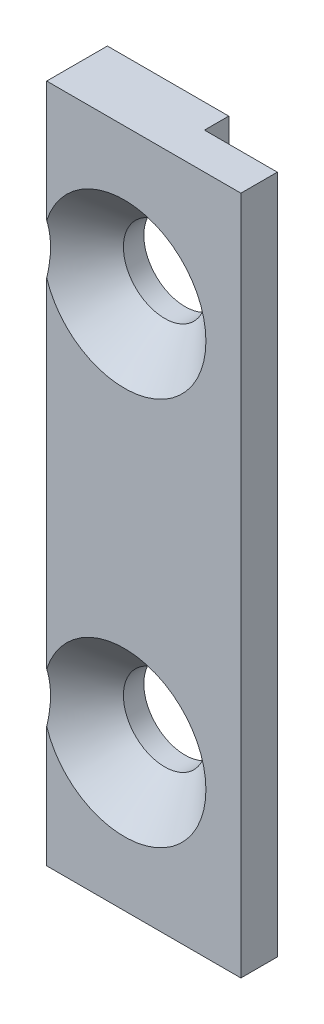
ISO-10303-21;
HEADER;
FILE_DESCRIPTION(('STEP AP214'),'2;1');
FILE_NAME('part.step','',(''),(''),'','','');
FILE_SCHEMA(('AUTOMOTIVE_DESIGN { 1 0 10303 214 1 1 1 1 }'));
ENDSEC;
DATA;
#1=APPLICATION_CONTEXT('core data for automotive mechanical design processes');
#2=APPLICATION_PROTOCOL_DEFINITION('international standard','automotive_design',2000,#1);
#3=PRODUCT_CONTEXT('',#1,'mechanical');
#4=PRODUCT('Part','Part','',(#3));
#5=PRODUCT_RELATED_PRODUCT_CATEGORY('part','',(#4));
#6=PRODUCT_DEFINITION_FORMATION('','',#4);
#7=PRODUCT_DEFINITION_CONTEXT('part definition',#1,'design');
#8=PRODUCT_DEFINITION('design','',#6,#7);
#9=PRODUCT_DEFINITION_SHAPE('','',#8);
#10=(LENGTH_UNIT() NAMED_UNIT(*) SI_UNIT(.MILLI.,.METRE.));
#11=(NAMED_UNIT(*) PLANE_ANGLE_UNIT() SI_UNIT($,.RADIAN.));
#12=(NAMED_UNIT(*) SI_UNIT($,.STERADIAN.) SOLID_ANGLE_UNIT());
#13=UNCERTAINTY_MEASURE_WITH_UNIT(LENGTH_MEASURE(1.E-05),#10,'distance_accuracy_value','');
#14=(GEOMETRIC_REPRESENTATION_CONTEXT(3) GLOBAL_UNCERTAINTY_ASSIGNED_CONTEXT((#13)) GLOBAL_UNIT_ASSIGNED_CONTEXT((#10,
#11,#12)) REPRESENTATION_CONTEXT('',''));
#15=CARTESIAN_POINT('',(0.,0.,0.));
#16=DIRECTION('',(0.,0.,1.));
#17=DIRECTION('',(1.,0.,0.));
#18=AXIS2_PLACEMENT_3D('',#15,#16,#17);
#19=CARTESIAN_POINT('',(0.,0.,2.5));
#20=DIRECTION('',(0.,0.,-1.));
#21=DIRECTION('',(-1.,0.,0.));
#22=AXIS2_PLACEMENT_3D('',#19,#20,#21);
#23=PLANE('',#22);
#24=DIRECTION('',(0.,-1.,0.));
#25=VECTOR('',#24,1.);
#26=CARTESIAN_POINT('',(-446.730887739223,-28.,2.5));
#27=LINE('',#26,#25);
#28=CARTESIAN_POINT('',(-446.730887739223,-7.02449987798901,2.5));
#29=VERTEX_POINT('',#28);
#30=CARTESIAN_POINT('',(-446.730887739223,-20.9755001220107,2.5));
#31=VERTEX_POINT('',#30);
#32=EDGE_CURVE('E235',#29,#31,#27,.T.);
#33=ORIENTED_EDGE('',*,*,#32,.T.);
#34=CARTESIAN_POINT('',(-443.530887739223,-22.,2.5));
#35=DIRECTION('',(0.,0.,1.));
#36=DIRECTION('',(1.,0.,0.));
#37=AXIS2_PLACEMENT_3D('',#34,#35,#36);
#38=CIRCLE('',#37,3.36);
#39=CARTESIAN_POINT('',(-446.730887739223,-23.0244998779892,2.5));
#40=VERTEX_POINT('',#39);
#41=EDGE_CURVE('E169',#40,#31,#38,.T.);
#42=ORIENTED_EDGE('',*,*,#41,.F.);
#43=CARTESIAN_POINT('',(-446.730887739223,-28.,2.5));
#44=VERTEX_POINT('',#43);
#45=EDGE_CURVE('E223',#40,#44,#27,.T.);
#46=ORIENTED_EDGE('',*,*,#45,.T.);
#47=DIRECTION('',(1.,0.,0.));
#48=VECTOR('',#47,1.);
#49=CARTESIAN_POINT('',(-446.730887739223,-28.,2.5));
#50=LINE('',#49,#48);
#51=CARTESIAN_POINT('',(-438.730887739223,-28.,2.5));
#52=VERTEX_POINT('',#51);
#53=EDGE_CURVE('E230',#44,#52,#50,.T.);
#54=ORIENTED_EDGE('',*,*,#53,.T.);
#55=DIRECTION('',(0.,1.,0.));
#56=VECTOR('',#55,1.);
#57=CARTESIAN_POINT('',(-438.730887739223,-28.,2.5));
#58=LINE('',#57,#56);
#59=CARTESIAN_POINT('',(-438.730887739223,2.22044604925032E-13,2.5));
#60=VERTEX_POINT('',#59);
#61=EDGE_CURVE('E228',#52,#60,#58,.T.);
#62=ORIENTED_EDGE('',*,*,#61,.T.);
#63=DIRECTION('',(-1.,0.,0.));
#64=VECTOR('',#63,1.);
#65=CARTESIAN_POINT('',(-446.730887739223,2.21706983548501E-13,2.5));
#66=LINE('',#65,#64);
#67=CARTESIAN_POINT('',(-446.730887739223,2.21706983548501E-13,2.5));
#68=VERTEX_POINT('',#67);
#69=EDGE_CURVE('E125',#60,#68,#66,.T.);
#70=ORIENTED_EDGE('',*,*,#69,.T.);
#71=CARTESIAN_POINT('',(-446.730887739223,-4.97550012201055,2.5));
#72=VERTEX_POINT('',#71);
#73=EDGE_CURVE('E232',#68,#72,#27,.T.);
#74=ORIENTED_EDGE('',*,*,#73,.T.);
#75=CARTESIAN_POINT('',(-443.530887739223,-5.99999999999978,2.5));
#76=DIRECTION('',(0.,0.,1.));
#77=DIRECTION('',(1.,0.,0.));
#78=AXIS2_PLACEMENT_3D('',#75,#76,#77);
#79=CIRCLE('',#78,3.36);
#80=EDGE_CURVE('E241',#29,#72,#79,.T.);
#81=ORIENTED_EDGE('',*,*,#80,.F.);
#82=EDGE_LOOP('',(#33,#42,#46,#54,#62,#70,#74,#81));
#83=FACE_BOUND('',#82,.T.);
#84=ADVANCED_FACE('F16',(#83),#23,.F.);
#85=CARTESIAN_POINT('',(-446.730887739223,-28.,2.5));
#86=DIRECTION('',(1.,0.,0.));
#87=DIRECTION('',(0.,0.,-1.));
#88=AXIS2_PLACEMENT_3D('',#85,#86,#87);
#89=PLANE('',#88);
#90=ORIENTED_EDGE('',*,*,#45,.F.);
#91=CARTESIAN_POINT('',(-446.730887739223,-33.0930996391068,10.6854259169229));
#92=CARTESIAN_POINT('',(-446.730887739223,-32.8166201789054,10.419802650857));
#93=CARTESIAN_POINT('',(-446.730887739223,-32.5397818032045,10.1545510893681));
#94=CARTESIAN_POINT('',(-446.730887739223,-31.9851345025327,9.62503470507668));
#95=CARTESIAN_POINT('',(-446.730887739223,-31.7073255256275,9.3607699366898));
#96=CARTESIAN_POINT('',(-446.730887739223,-31.1497326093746,8.83275917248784));
#97=CARTESIAN_POINT('',(-446.730887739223,-30.869945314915,8.56901671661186));
#98=CARTESIAN_POINT('',(-446.730887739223,-30.3088263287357,8.04320069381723));
#99=CARTESIAN_POINT('',(-446.730887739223,-30.0274946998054,7.78112705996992));
#100=CARTESIAN_POINT('',(-446.730887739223,-29.428949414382,7.2279342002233));
#101=CARTESIAN_POINT('',(-446.730887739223,-29.1114749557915,6.93709679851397));
#102=CARTESIAN_POINT('',(-446.730887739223,-28.4728607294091,6.35936669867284));
#103=CARTESIAN_POINT('',(-446.730887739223,-28.15172047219,6.07247453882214));
#104=CARTESIAN_POINT('',(-446.730887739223,-27.6662505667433,5.64695184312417));
#105=CARTESIAN_POINT('',(-446.730887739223,-27.5039340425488,5.50602605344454));
#106=CARTESIAN_POINT('',(-446.730887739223,-27.1776349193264,5.2261189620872));
#107=CARTESIAN_POINT('',(-446.730887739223,-27.0136523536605,5.08713762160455));
#108=CARTESIAN_POINT('',(-446.730887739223,-26.6836373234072,4.81170169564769));
#109=CARTESIAN_POINT('',(-446.730887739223,-26.5176053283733,4.67524654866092));
#110=CARTESIAN_POINT('',(-446.730887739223,-26.1828995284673,4.40562308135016));
#111=CARTESIAN_POINT('',(-446.730887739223,-26.0142259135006,4.27245452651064));
#112=CARTESIAN_POINT('',(-446.730887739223,-25.7371029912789,4.05948135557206));
#113=CARTESIAN_POINT('',(-446.730887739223,-25.6296934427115,3.9783248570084));
#114=CARTESIAN_POINT('',(-446.730887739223,-25.413276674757,3.81815705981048));
#115=CARTESIAN_POINT('',(-446.730887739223,-25.3042694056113,3.73914582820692));
#116=CARTESIAN_POINT('',(-446.730887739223,-25.0841695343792,3.58364976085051));
#117=CARTESIAN_POINT('',(-446.730887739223,-24.9730735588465,3.50716968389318));
#118=CARTESIAN_POINT('',(-446.730887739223,-24.7486319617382,3.35757923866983));
#119=CARTESIAN_POINT('',(-446.730887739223,-24.6352864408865,3.28446872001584));
#120=CARTESIAN_POINT('',(-446.730887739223,-24.4082150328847,3.14396082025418));
#121=CARTESIAN_POINT('',(-446.730887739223,-24.2945420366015,3.07647845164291));
#122=CARTESIAN_POINT('',(-446.730887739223,-24.0641602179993,2.94679510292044));
#123=CARTESIAN_POINT('',(-446.730887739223,-23.9474506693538,2.88459540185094));
#124=CARTESIAN_POINT('',(-446.730887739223,-23.7109541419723,2.76723786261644));
#125=CARTESIAN_POINT('',(-446.730887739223,-23.5911776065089,2.71205917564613));
#126=CARTESIAN_POINT('',(-446.730887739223,-23.3479608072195,2.6105635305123));
#127=CARTESIAN_POINT('',(-446.730887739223,-23.2245234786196,2.56423968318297));
#128=CARTESIAN_POINT('',(-446.730887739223,-23.0196695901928,2.49768722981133));
#129=CARTESIAN_POINT('',(-446.730887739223,-22.9393423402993,2.47410246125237));
#130=CARTESIAN_POINT('',(-446.730887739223,-22.777318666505,2.43212761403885));
#131=CARTESIAN_POINT('',(-446.730887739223,-22.6956221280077,2.41373797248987));
#132=CARTESIAN_POINT('',(-446.730887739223,-22.5313449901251,2.38281389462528));
#133=CARTESIAN_POINT('',(-446.730887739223,-22.4487673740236,2.37026378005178));
#134=CARTESIAN_POINT('',(-446.730887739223,-22.282901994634,2.35142389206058));
#135=CARTESIAN_POINT('',(-446.730887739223,-22.1996142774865,2.34513371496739));
#136=CARTESIAN_POINT('',(-446.730887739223,-22.0146206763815,2.33842573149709));
#137=CARTESIAN_POINT('',(-446.730887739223,-21.9128529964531,2.33958472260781));
#138=CARTESIAN_POINT('',(-446.730887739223,-21.7098861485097,2.35152483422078));
#139=CARTESIAN_POINT('',(-446.730887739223,-21.6086870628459,2.36230731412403));
#140=CARTESIAN_POINT('',(-446.730887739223,-21.4072554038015,2.39290457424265));
#141=CARTESIAN_POINT('',(-446.730887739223,-21.307028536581,2.41275641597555));
#142=CARTESIAN_POINT('',(-446.730887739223,-21.1085230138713,2.46045804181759));
#143=CARTESIAN_POINT('',(-446.730887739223,-21.0102446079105,2.48830884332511));
#144=CARTESIAN_POINT('',(-446.730887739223,-20.7219771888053,2.58101112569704));
#145=CARTESIAN_POINT('',(-446.730887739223,-20.5351057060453,2.65561596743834));
#146=CARTESIAN_POINT('',(-446.730887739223,-20.2611460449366,2.78101866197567));
#147=CARTESIAN_POINT('',(-446.730887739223,-20.1707982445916,2.82511890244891));
#148=CARTESIAN_POINT('',(-446.730887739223,-19.9920177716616,2.91705108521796));
#149=CARTESIAN_POINT('',(-446.730887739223,-19.9035848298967,2.96488249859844));
#150=CARTESIAN_POINT('',(-446.730887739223,-19.7272121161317,3.06430676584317));
#151=CARTESIAN_POINT('',(-446.730887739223,-19.6392973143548,3.11594349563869));
#152=CARTESIAN_POINT('',(-446.730887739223,-19.4650466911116,3.22181348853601));
#153=CARTESIAN_POINT('',(-446.730887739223,-19.3787109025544,3.27604680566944));
#154=CARTESIAN_POINT('',(-446.730887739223,-19.2075043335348,3.38661777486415));
#155=CARTESIAN_POINT('',(-446.730887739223,-19.1226323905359,3.44295363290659));
#156=CARTESIAN_POINT('',(-446.730887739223,-18.9541159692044,3.55741963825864));
#157=CARTESIAN_POINT('',(-446.730887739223,-18.8704714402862,3.61554971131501));
#158=CARTESIAN_POINT('',(-446.730887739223,-18.5966297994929,3.8095529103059));
#159=CARTESIAN_POINT('',(-446.730887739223,-18.4087019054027,3.94863037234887));
#160=CARTESIAN_POINT('',(-446.730887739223,-18.0370010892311,4.23224854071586));
#161=CARTESIAN_POINT('',(-446.730887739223,-17.8532289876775,4.37679031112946));
#162=CARTESIAN_POINT('',(-446.730887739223,-17.4887486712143,4.66988748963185));
#163=CARTESIAN_POINT('',(-446.730887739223,-17.3080422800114,4.81844515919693));
#164=CARTESIAN_POINT('',(-446.730887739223,-16.9490678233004,5.11847997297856));
#165=CARTESIAN_POINT('',(-446.730887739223,-16.7707998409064,5.26995721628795));
#166=CARTESIAN_POINT('',(-446.730887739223,-16.4157127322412,5.57553164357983));
#167=CARTESIAN_POINT('',(-446.730887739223,-16.238898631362,5.72963465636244));
#168=CARTESIAN_POINT('',(-446.730887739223,-15.8868017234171,6.03958296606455));
#169=CARTESIAN_POINT('',(-446.730887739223,-15.7115189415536,6.19542829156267));
#170=CARTESIAN_POINT('',(-446.730887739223,-15.1876362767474,6.66489985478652));
#171=CARTESIAN_POINT('',(-446.730887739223,-14.8408725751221,6.98057412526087));
#172=CARTESIAN_POINT('',(-446.730887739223,-14.1929517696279,7.57659065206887));
#173=CARTESIAN_POINT('',(-446.730887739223,-13.8914141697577,7.85652112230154));
#174=CARTESIAN_POINT('',(-446.730887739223,-13.2901951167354,8.41843000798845));
#175=CARTESIAN_POINT('',(-446.730887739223,-12.9905138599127,8.70040863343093));
#176=CARTESIAN_POINT('',(-446.730887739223,-12.3940521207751,9.26446839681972));
#177=CARTESIAN_POINT('',(-446.730887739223,-12.0972646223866,9.54654212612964));
#178=CARTESIAN_POINT('',(-446.730887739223,-11.5048361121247,10.1118182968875));
#179=CARTESIAN_POINT('',(-446.730887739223,-11.2091949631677,10.3950205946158));
#180=CARTESIAN_POINT('',(-446.730887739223,-10.9139597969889,10.6786432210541));
#181=B_SPLINE_CURVE_WITH_KNOTS('',3,(#91,#92,#93,#94,#95,#96,#97,#98,#99,#100,#101,#102,#103,
#104,#105,#106,#107,#108,#109,#110,#111,#112,#113,#114,#115,#116,#117,#118,#119,#120,#121,#122,
#123,#124,#125,#126,#127,#128,#129,#130,#131,#132,#133,#134,#135,#136,#137,#138,#139,#140,#141,
#142,#143,#144,#145,#146,#147,#148,#149,#150,#151,#152,#153,#154,#155,#156,#157,#158,#159,#160,
#161,#162,#163,#164,#165,#166,#167,#168,#169,#170,#171,#172,#173,#174,#175,#176,#177,#178,#179,
#180),.UNSPECIFIED.,.F.,.F.,(4,2,2,2,2,2,2,2,2,2,2,2,2,2,2,2,2,2,2,2,2,2,2,2,2,2,2,2,2,2,2,2,2,
2,2,2,2,2,2,2,2,2,2,2,4),(0.,1.15020572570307,2.30047396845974,3.45397189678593,
4.60742326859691,5.89906477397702,7.19088079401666,7.83574206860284,8.48059045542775,
9.12529374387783,9.76995089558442,10.1737973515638,10.5776564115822,10.9822359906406,
11.3867974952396,11.7832722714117,12.1798427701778,12.5752067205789,12.9702618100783,
13.2212701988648,13.4722997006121,13.7226512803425,13.9729867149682,14.2778280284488,
14.5827124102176,14.8888539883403,15.1950345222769,15.7969882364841,16.098559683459,
16.4000884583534,16.7059125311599,17.0117429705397,17.3173181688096,17.622880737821,
18.3240936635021,19.0254438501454,19.7271975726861,20.4289751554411,21.1325930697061,
21.8362225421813,23.2429670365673,24.4772892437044,25.7117398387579,26.9400833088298,
28.1682750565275),.UNSPECIFIED.);
#182=EDGE_CURVE('E144',#40,#31,#181,.T.);
#183=ORIENTED_EDGE('',*,*,#182,.T.);
#184=ORIENTED_EDGE('',*,*,#32,.F.);
#185=CARTESIAN_POINT('',(-446.730887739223,-17.0930996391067,10.6854259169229));
#186=CARTESIAN_POINT('',(-446.730887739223,-16.8166201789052,10.419802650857));
#187=CARTESIAN_POINT('',(-446.730887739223,-16.5397818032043,10.1545510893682));
#188=CARTESIAN_POINT('',(-446.730887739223,-15.9851345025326,9.62503470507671));
#189=CARTESIAN_POINT('',(-446.730887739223,-15.7073255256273,9.36076993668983));
#190=CARTESIAN_POINT('',(-446.730887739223,-15.1497326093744,8.83275917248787));
#191=CARTESIAN_POINT('',(-446.730887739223,-14.8699453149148,8.56901671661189));
#192=CARTESIAN_POINT('',(-446.730887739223,-14.3088263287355,8.04320069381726));
#193=CARTESIAN_POINT('',(-446.730887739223,-14.0274946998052,7.78112705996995));
#194=CARTESIAN_POINT('',(-446.730887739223,-13.4289494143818,7.22793420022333));
#195=CARTESIAN_POINT('',(-446.730887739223,-13.1114749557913,6.93709679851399));
#196=CARTESIAN_POINT('',(-446.730887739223,-12.4728607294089,6.35936669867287));
#197=CARTESIAN_POINT('',(-446.730887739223,-12.1517204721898,6.07247453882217));
#198=CARTESIAN_POINT('',(-446.730887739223,-11.6662505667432,5.64695184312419));
#199=CARTESIAN_POINT('',(-446.730887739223,-11.5039340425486,5.50602605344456));
#200=CARTESIAN_POINT('',(-446.730887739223,-11.1776349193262,5.22611896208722));
#201=CARTESIAN_POINT('',(-446.730887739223,-11.0136523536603,5.08713762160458));
#202=CARTESIAN_POINT('',(-446.730887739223,-10.683637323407,4.81170169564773));
#203=CARTESIAN_POINT('',(-446.730887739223,-10.5176053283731,4.67524654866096));
#204=CARTESIAN_POINT('',(-446.730887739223,-10.1828995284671,4.40562308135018));
#205=CARTESIAN_POINT('',(-446.730887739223,-10.0142259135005,4.27245452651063));
#206=CARTESIAN_POINT('',(-446.730887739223,-9.73710299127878,4.05948135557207));
#207=CARTESIAN_POINT('',(-446.730887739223,-9.6296934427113,3.97832485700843));
#208=CARTESIAN_POINT('',(-446.730887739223,-9.41327667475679,3.81815705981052));
#209=CARTESIAN_POINT('',(-446.730887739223,-9.30426940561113,3.73914582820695));
#210=CARTESIAN_POINT('',(-446.730887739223,-9.08416953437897,3.58364976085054));
#211=CARTESIAN_POINT('',(-446.730887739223,-8.97307355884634,3.5071696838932));
#212=CARTESIAN_POINT('',(-446.730887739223,-8.74863196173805,3.35757923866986));
#213=CARTESIAN_POINT('',(-446.730887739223,-8.63528644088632,3.28446872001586));
#214=CARTESIAN_POINT('',(-446.730887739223,-8.40821503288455,3.14396082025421));
#215=CARTESIAN_POINT('',(-446.730887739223,-8.29454203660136,3.07647845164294));
#216=CARTESIAN_POINT('',(-446.730887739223,-8.06416021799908,2.94679510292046));
#217=CARTESIAN_POINT('',(-446.730887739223,-7.94745066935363,2.88459540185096));
#218=CARTESIAN_POINT('',(-446.730887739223,-7.71095414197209,2.76723786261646));
#219=CARTESIAN_POINT('',(-446.730887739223,-7.59117760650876,2.71205917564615));
#220=CARTESIAN_POINT('',(-446.730887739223,-7.34796080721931,2.61056353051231));
#221=CARTESIAN_POINT('',(-446.730887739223,-7.22452347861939,2.56423968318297));
#222=CARTESIAN_POINT('',(-446.730887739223,-7.01966959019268,2.49768722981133));
#223=CARTESIAN_POINT('',(-446.730887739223,-6.93934234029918,2.47410246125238));
#224=CARTESIAN_POINT('',(-446.730887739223,-6.77731866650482,2.43212761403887));
#225=CARTESIAN_POINT('',(-446.730887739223,-6.69562212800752,2.41373797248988));
#226=CARTESIAN_POINT('',(-446.730887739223,-6.53134499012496,2.38281389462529));
#227=CARTESIAN_POINT('',(-446.730887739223,-6.44876737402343,2.37026378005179));
#228=CARTESIAN_POINT('',(-446.730887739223,-6.2829019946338,2.35142389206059));
#229=CARTESIAN_POINT('',(-446.730887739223,-6.19961427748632,2.34513371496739));
#230=CARTESIAN_POINT('',(-446.730887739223,-6.01462067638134,2.33842573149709));
#231=CARTESIAN_POINT('',(-446.730887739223,-5.91285299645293,2.33958472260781));
#232=CARTESIAN_POINT('',(-446.730887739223,-5.70988614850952,2.35152483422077));
#233=CARTESIAN_POINT('',(-446.730887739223,-5.60868706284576,2.36230731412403));
#234=CARTESIAN_POINT('',(-446.730887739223,-5.40725540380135,2.39290457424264));
#235=CARTESIAN_POINT('',(-446.730887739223,-5.3070285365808,2.41275641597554));
#236=CARTESIAN_POINT('',(-446.730887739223,-5.10852301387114,2.46045804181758));
#237=CARTESIAN_POINT('',(-446.730887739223,-5.01024460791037,2.48830884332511));
#238=CARTESIAN_POINT('',(-446.730887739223,-4.72197718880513,2.58101112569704));
#239=CARTESIAN_POINT('',(-446.730887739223,-4.53510570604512,2.65561596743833));
#240=CARTESIAN_POINT('',(-446.730887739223,-4.26114604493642,2.78101866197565));
#241=CARTESIAN_POINT('',(-446.730887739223,-4.17079824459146,2.82511890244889));
#242=CARTESIAN_POINT('',(-446.730887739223,-3.99201777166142,2.91705108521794));
#243=CARTESIAN_POINT('',(-446.730887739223,-3.90358482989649,2.96488249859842));
#244=CARTESIAN_POINT('',(-446.730887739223,-3.72721211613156,3.06430676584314));
#245=CARTESIAN_POINT('',(-446.730887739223,-3.63929731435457,3.11594349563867));
#246=CARTESIAN_POINT('',(-446.730887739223,-3.46504669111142,3.22181348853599));
#247=CARTESIAN_POINT('',(-446.730887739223,-3.37871090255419,3.27604680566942));
#248=CARTESIAN_POINT('',(-446.730887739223,-3.20750433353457,3.38661777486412));
#249=CARTESIAN_POINT('',(-446.730887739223,-3.12263239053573,3.44295363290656));
#250=CARTESIAN_POINT('',(-446.730887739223,-2.95411596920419,3.55741963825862));
#251=CARTESIAN_POINT('',(-446.730887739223,-2.87047144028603,3.61554971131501));
#252=CARTESIAN_POINT('',(-446.730887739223,-2.5966297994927,3.80955291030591));
#253=CARTESIAN_POINT('',(-446.730887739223,-2.40870190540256,3.94863037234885));
#254=CARTESIAN_POINT('',(-446.730887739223,-2.03700108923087,4.23224854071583));
#255=CARTESIAN_POINT('',(-446.730887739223,-1.85322898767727,4.37679031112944));
#256=CARTESIAN_POINT('',(-446.730887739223,-1.48874867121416,4.66988748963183));
#257=CARTESIAN_POINT('',(-446.730887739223,-1.30804228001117,4.81844515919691));
#258=CARTESIAN_POINT('',(-446.730887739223,-0.949067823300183,5.11847997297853));
#259=CARTESIAN_POINT('',(-446.730887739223,-0.770799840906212,5.26995721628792));
#260=CARTESIAN_POINT('',(-446.730887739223,-0.415712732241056,5.57553164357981));
#261=CARTESIAN_POINT('',(-446.730887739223,-0.238898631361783,5.72963465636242));
#262=CARTESIAN_POINT('',(-446.730887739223,0.113198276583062,6.03958296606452));
#263=CARTESIAN_POINT('',(-446.730887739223,0.288481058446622,6.19542829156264));
#264=CARTESIAN_POINT('',(-446.730887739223,0.812363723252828,6.66489985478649));
#265=CARTESIAN_POINT('',(-446.730887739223,1.15912742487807,6.98057412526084));
#266=CARTESIAN_POINT('',(-446.730887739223,1.80704823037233,7.57659065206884));
#267=CARTESIAN_POINT('',(-446.730887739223,2.10858583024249,7.85652112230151));
#268=CARTESIAN_POINT('',(-446.730887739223,2.70980488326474,8.41843000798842));
#269=CARTESIAN_POINT('',(-446.730887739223,3.00948614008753,8.7004086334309));
#270=CARTESIAN_POINT('',(-446.730887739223,3.60594787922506,9.26446839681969));
#271=CARTESIAN_POINT('',(-446.730887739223,3.9027353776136,9.5465421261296));
#272=CARTESIAN_POINT('',(-446.730887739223,4.4951638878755,10.1118182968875));
#273=CARTESIAN_POINT('',(-446.730887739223,4.79080503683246,10.3950205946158));
#274=CARTESIAN_POINT('',(-446.730887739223,5.08604020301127,10.6786432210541));
#275=B_SPLINE_CURVE_WITH_KNOTS('',3,(#185,#186,#187,#188,#189,#190,#191,#192,#193,#194,#195,
#196,#197,#198,#199,#200,#201,#202,#203,#204,#205,#206,#207,#208,#209,#210,#211,#212,#213,#214,
#215,#216,#217,#218,#219,#220,#221,#222,#223,#224,#225,#226,#227,#228,#229,#230,#231,#232,#233,
#234,#235,#236,#237,#238,#239,#240,#241,#242,#243,#244,#245,#246,#247,#248,#249,#250,#251,#252,
#253,#254,#255,#256,#257,#258,#259,#260,#261,#262,#263,#264,#265,#266,#267,#268,#269,#270,#271,
#272,#273,#274),.UNSPECIFIED.,.F.,.F.,(4,2,2,2,2,2,2,2,2,2,2,2,2,2,2,2,2,2,2,2,2,2,2,2,2,2,2,2,
2,2,2,2,2,2,2,2,2,2,2,2,2,2,2,2,4),(0.,1.15020572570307,2.30047396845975,3.45397189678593,
4.60742326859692,5.89906477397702,7.19088079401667,7.83574206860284,8.48059045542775,
9.12529374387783,9.76995089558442,10.1737973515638,10.5776564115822,10.9822359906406,
11.3867974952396,11.7832722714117,12.1798427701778,12.5752067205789,12.9702618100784,
13.2212701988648,13.4722997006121,13.7226512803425,13.9729867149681,14.2778280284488,
14.5827124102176,14.8888539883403,15.1950345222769,15.7969882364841,16.098559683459,
16.4000884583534,16.7059125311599,17.0117429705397,17.3173181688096,17.622880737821,
18.3240936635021,19.0254438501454,19.7271975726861,20.4289751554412,21.1325930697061,
21.8362225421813,23.2429670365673,24.4772892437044,25.7117398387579,26.9400833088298,
28.1682750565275),.UNSPECIFIED.);
#276=EDGE_CURVE('E136',#29,#72,#275,.T.);
#277=ORIENTED_EDGE('',*,*,#276,.T.);
#278=ORIENTED_EDGE('',*,*,#73,.F.);
#279=DIRECTION('',(0.,0.,-1.));
#280=VECTOR('',#279,1.);
#281=CARTESIAN_POINT('',(-446.730887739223,2.21706983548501E-13,2.5));
#282=LINE('',#281,#280);
#283=CARTESIAN_POINT('',(-446.730887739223,2.21706983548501E-13,0.));
#284=VERTEX_POINT('',#283);
#285=EDGE_CURVE('E126',#68,#284,#282,.T.);
#286=ORIENTED_EDGE('',*,*,#285,.T.);
#287=DIRECTION('',(0.,-1.,0.));
#288=VECTOR('',#287,1.);
#289=CARTESIAN_POINT('',(-446.730887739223,-28.,0.));
#290=LINE('',#289,#288);
#291=CARTESIAN_POINT('',(-446.730887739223,-28.,0.));
#292=VERTEX_POINT('',#291);
#293=EDGE_CURVE('E221',#284,#292,#290,.T.);
#294=ORIENTED_EDGE('',*,*,#293,.T.);
#295=DIRECTION('',(0.,0.,-1.));
#296=VECTOR('',#295,1.);
#297=CARTESIAN_POINT('',(-446.730887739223,-28.,2.5));
#298=LINE('',#297,#296);
#299=EDGE_CURVE('E128',#44,#292,#298,.T.);
#300=ORIENTED_EDGE('',*,*,#299,.F.);
#301=EDGE_LOOP('',(#90,#183,#184,#277,#278,#286,#294,#300));
#302=FACE_BOUND('',#301,.T.);
#303=ADVANCED_FACE('F18',(#302),#89,.F.);
#304=CARTESIAN_POINT('',(-446.730887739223,-28.,2.5));
#305=DIRECTION('',(0.,1.,0.));
#306=DIRECTION('',(0.,0.,1.));
#307=AXIS2_PLACEMENT_3D('',#304,#305,#306);
#308=PLANE('',#307);
#309=DIRECTION('',(1.,0.,0.));
#310=VECTOR('',#309,1.);
#311=CARTESIAN_POINT('',(-446.730887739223,-28.,0.));
#312=LINE('',#311,#310);
#313=CARTESIAN_POINT('',(-441.730887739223,-28.,0.));
#314=VERTEX_POINT('',#313);
#315=EDGE_CURVE('E215',#292,#314,#312,.T.);
#316=ORIENTED_EDGE('',*,*,#315,.T.);
#317=DIRECTION('',(0.,0.,-1.));
#318=VECTOR('',#317,1.);
#319=CARTESIAN_POINT('',(-441.730887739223,-28.,0.));
#320=LINE('',#319,#318);
#321=CARTESIAN_POINT('',(-441.730887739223,-28.,1.));
#322=VERTEX_POINT('',#321);
#323=EDGE_CURVE('E38',#322,#314,#320,.T.);
#324=ORIENTED_EDGE('',*,*,#323,.F.);
#325=DIRECTION('',(-1.,0.,0.));
#326=VECTOR('',#325,1.);
#327=CARTESIAN_POINT('',(-438.730887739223,-28.,1.));
#328=LINE('',#327,#326);
#329=CARTESIAN_POINT('',(-438.730887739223,-28.,1.));
#330=VERTEX_POINT('',#329);
#331=EDGE_CURVE('E261',#330,#322,#328,.T.);
#332=ORIENTED_EDGE('',*,*,#331,.F.);
#333=DIRECTION('',(0.,0.,-1.));
#334=VECTOR('',#333,1.);
#335=CARTESIAN_POINT('',(-438.730887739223,-28.,2.5));
#336=LINE('',#335,#334);
#337=EDGE_CURVE('E120',#52,#330,#336,.T.);
#338=ORIENTED_EDGE('',*,*,#337,.F.);
#339=ORIENTED_EDGE('',*,*,#53,.F.);
#340=ORIENTED_EDGE('',*,*,#299,.T.);
#341=EDGE_LOOP('',(#316,#324,#332,#338,#339,#340));
#342=FACE_BOUND('',#341,.T.);
#343=ADVANCED_FACE('F199',(#342),#308,.F.);
#344=CARTESIAN_POINT('',(-438.730887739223,-28.,2.5));
#345=DIRECTION('',(-1.,0.,0.));
#346=DIRECTION('',(0.,0.,1.));
#347=AXIS2_PLACEMENT_3D('',#344,#345,#346);
#348=PLANE('',#347);
#349=ORIENTED_EDGE('',*,*,#337,.T.);
#350=DIRECTION('',(0.,-1.,0.));
#351=VECTOR('',#350,1.);
#352=CARTESIAN_POINT('',(-438.730887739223,2.22044604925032E-13,1.));
#353=LINE('',#352,#351);
#354=CARTESIAN_POINT('',(-438.730887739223,2.22044604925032E-13,1.));
#355=VERTEX_POINT('',#354);
#356=EDGE_CURVE('E102',#355,#330,#353,.T.);
#357=ORIENTED_EDGE('',*,*,#356,.F.);
#358=DIRECTION('',(0.,0.,-1.));
#359=VECTOR('',#358,1.);
#360=CARTESIAN_POINT('',(-438.730887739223,2.22044604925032E-13,2.5));
#361=LINE('',#360,#359);
#362=EDGE_CURVE('E117',#60,#355,#361,.T.);
#363=ORIENTED_EDGE('',*,*,#362,.F.);
#364=ORIENTED_EDGE('',*,*,#61,.F.);
#365=EDGE_LOOP('',(#349,#357,#363,#364));
#366=FACE_BOUND('',#365,.T.);
#367=ADVANCED_FACE('F115',(#366),#348,.F.);
#368=CARTESIAN_POINT('',(-446.730887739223,2.21706983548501E-13,2.5));
#369=DIRECTION('',(0.,-1.,0.));
#370=DIRECTION('',(1.,0.,0.));
#371=AXIS2_PLACEMENT_3D('',#368,#369,#370);
#372=PLANE('',#371);
#373=DIRECTION('',(-1.,0.,0.));
#374=VECTOR('',#373,1.);
#375=CARTESIAN_POINT('',(-438.730887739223,2.22044604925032E-13,1.));
#376=LINE('',#375,#374);
#377=CARTESIAN_POINT('',(-441.730887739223,2.22044604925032E-13,1.));
#378=VERTEX_POINT('',#377);
#379=EDGE_CURVE('E98',#355,#378,#376,.T.);
#380=ORIENTED_EDGE('',*,*,#379,.T.);
#381=DIRECTION('',(0.,0.,-1.));
#382=VECTOR('',#381,1.);
#383=CARTESIAN_POINT('',(-441.730887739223,2.22044604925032E-13,0.));
#384=LINE('',#383,#382);
#385=CARTESIAN_POINT('',(-441.730887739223,2.22044604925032E-13,0.));
#386=VERTEX_POINT('',#385);
#387=EDGE_CURVE('E110',#378,#386,#384,.T.);
#388=ORIENTED_EDGE('',*,*,#387,.T.);
#389=DIRECTION('',(-1.,0.,0.));
#390=VECTOR('',#389,1.);
#391=CARTESIAN_POINT('',(-446.730887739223,2.21706983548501E-13,0.));
#392=LINE('',#391,#390);
#393=EDGE_CURVE('E220',#386,#284,#392,.T.);
#394=ORIENTED_EDGE('',*,*,#393,.T.);
#395=ORIENTED_EDGE('',*,*,#285,.F.);
#396=ORIENTED_EDGE('',*,*,#69,.F.);
#397=ORIENTED_EDGE('',*,*,#362,.T.);
#398=EDGE_LOOP('',(#380,#388,#394,#395,#396,#397));
#399=FACE_BOUND('',#398,.T.);
#400=ADVANCED_FACE('F123',(#399),#372,.F.);
#401=CARTESIAN_POINT('',(0.,0.,0.));
#402=DIRECTION('',(0.,0.,-1.));
#403=DIRECTION('',(-1.,0.,0.));
#404=AXIS2_PLACEMENT_3D('',#401,#402,#403);
#405=PLANE('',#404);
#406=DIRECTION('',(0.,-1.,0.));
#407=VECTOR('',#406,1.);
#408=CARTESIAN_POINT('',(-441.730887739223,2.22044604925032E-13,0.));
#409=LINE('',#408,#407);
#410=EDGE_CURVE('E258',#386,#314,#409,.T.);
#411=ORIENTED_EDGE('',*,*,#410,.T.);
#412=ORIENTED_EDGE('',*,*,#315,.F.);
#413=ORIENTED_EDGE('',*,*,#293,.F.);
#414=ORIENTED_EDGE('',*,*,#393,.F.);
#415=EDGE_LOOP('',(#411,#412,#413,#414));
#416=FACE_BOUND('',#415,.T.);
#417=CARTESIAN_POINT('',(-443.530887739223,-22.,0.));
#418=DIRECTION('',(0.,0.,1.));
#419=DIRECTION('',(1.,0.,0.));
#420=AXIS2_PLACEMENT_3D('',#417,#418,#419);
#421=CIRCLE('',#420,1.7);
#422=CARTESIAN_POINT('',(-441.830887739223,-22.,0.));
#423=VERTEX_POINT('',#422);
#424=EDGE_CURVE('E243',#423,#423,#421,.T.);
#425=ORIENTED_EDGE('',*,*,#424,.T.);
#426=EDGE_LOOP('',(#425));
#427=FACE_BOUND('',#426,.T.);
#428=CARTESIAN_POINT('',(-443.530887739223,-5.99999999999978,0.));
#429=DIRECTION('',(0.,0.,1.));
#430=DIRECTION('',(1.,0.,0.));
#431=AXIS2_PLACEMENT_3D('',#428,#429,#430);
#432=CIRCLE('',#431,1.7);
#433=CARTESIAN_POINT('',(-441.830887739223,-5.99999999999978,0.));
#434=VERTEX_POINT('',#433);
#435=EDGE_CURVE('E224',#434,#434,#432,.T.);
#436=ORIENTED_EDGE('',*,*,#435,.T.);
#437=EDGE_LOOP('',(#436));
#438=FACE_BOUND('',#437,.T.);
#439=ADVANCED_FACE('F155',(#416,#427,#438),#405,.T.);
#440=CARTESIAN_POINT('',(-443.530887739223,-5.99999999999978,2.5));
#441=DIRECTION('',(0.,0.,1.));
#442=DIRECTION('',(1.,0.,0.));
#443=AXIS2_PLACEMENT_3D('',#440,#441,#442);
#444=CONICAL_SURFACE('',#443,3.36,0.785398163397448);
#445=CARTESIAN_POINT('',(-443.530887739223,-5.99999999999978,1.));
#446=DIRECTION('',(0.,0.,1.));
#447=DIRECTION('',(1.,0.,0.));
#448=AXIS2_PLACEMENT_3D('',#445,#446,#447);
#449=CIRCLE('',#448,1.85999999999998);
#450=CARTESIAN_POINT('',(-441.730887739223,-5.53138501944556,1.));
#451=VERTEX_POINT('',#450);
#452=CARTESIAN_POINT('',(-441.730887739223,-6.468614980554,1.));
#453=VERTEX_POINT('',#452);
#454=EDGE_CURVE('E170',#451,#453,#449,.F.);
#455=ORIENTED_EDGE('',*,*,#454,.T.);
#456=CARTESIAN_POINT('',(-441.730887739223,-7.20930757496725,1.30850750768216));
#457=CARTESIAN_POINT('',(-441.730887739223,-7.14653574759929,1.27354895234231));
#458=CARTESIAN_POINT('',(-441.730887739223,-7.0830174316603,1.23996260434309));
#459=CARTESIAN_POINT('',(-441.730887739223,-6.95392417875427,1.17635588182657));
#460=CARTESIAN_POINT('',(-441.730887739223,-6.88834222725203,1.14634982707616));
#461=CARTESIAN_POINT('',(-441.730887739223,-6.68691813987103,1.06273110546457));
#462=CARTESIAN_POINT('',(-441.730887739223,-6.54777296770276,1.01633543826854));
#463=CARTESIAN_POINT('',(-441.730887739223,-6.31565104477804,0.965389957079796));
#464=CARTESIAN_POINT('',(-441.730887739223,-6.22473742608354,0.951696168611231));
#465=CARTESIAN_POINT('',(-441.730887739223,-6.08797008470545,0.941574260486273));
#466=CARTESIAN_POINT('',(-441.730887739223,-6.04247387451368,0.939924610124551));
#467=CARTESIAN_POINT('',(-441.730887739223,-5.95149085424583,0.940080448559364));
#468=CARTESIAN_POINT('',(-441.730887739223,-5.90600404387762,0.941885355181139));
#469=CARTESIAN_POINT('',(-441.730887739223,-5.80872574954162,0.949393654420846));
#470=CARTESIAN_POINT('',(-441.730887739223,-5.75697484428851,0.955623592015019));
#471=CARTESIAN_POINT('',(-441.730887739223,-5.65415392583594,0.97222088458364));
#472=CARTESIAN_POINT('',(-441.730887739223,-5.60308388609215,0.982588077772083));
#473=CARTESIAN_POINT('',(-441.730887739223,-5.50123268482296,1.00716237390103));
#474=CARTESIAN_POINT('',(-441.730887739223,-5.45046247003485,1.0214143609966));
#475=CARTESIAN_POINT('',(-441.730887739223,-5.34997792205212,1.0531795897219));
#476=CARTESIAN_POINT('',(-441.730887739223,-5.30026335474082,1.07069209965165));
#477=CARTESIAN_POINT('',(-441.730887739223,-5.18266812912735,1.11586387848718));
#478=CARTESIAN_POINT('',(-441.730887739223,-5.11528465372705,1.14481324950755));
#479=CARTESIAN_POINT('',(-441.730887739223,-4.98244671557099,1.20687263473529));
#480=CARTESIAN_POINT('',(-441.730887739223,-4.91699337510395,1.2399850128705));
#481=CARTESIAN_POINT('',(-441.730887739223,-4.78759919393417,1.30954602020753));
#482=CARTESIAN_POINT('',(-441.730887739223,-4.72366452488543,1.34600604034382));
#483=CARTESIAN_POINT('',(-441.730887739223,-4.59729824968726,1.42144763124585));
#484=CARTESIAN_POINT('',(-441.730887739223,-4.53486687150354,1.46042958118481));
#485=CARTESIAN_POINT('',(-441.730887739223,-4.41437178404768,1.53837737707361));
#486=CARTESIAN_POINT('',(-441.730887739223,-4.35624553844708,1.57724705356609));
#487=CARTESIAN_POINT('',(-441.730887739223,-4.24097855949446,1.65642671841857));
#488=CARTESIAN_POINT('',(-441.730887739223,-4.18383790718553,1.69673682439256));
#489=CARTESIAN_POINT('',(-441.730887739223,-4.07090630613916,1.77815882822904));
#490=CARTESIAN_POINT('',(-441.730887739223,-4.01510786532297,1.81926037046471));
#491=CARTESIAN_POINT('',(-441.730887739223,-3.90423956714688,1.90240530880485));
#492=CARTESIAN_POINT('',(-441.730887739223,-3.84916951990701,1.94444845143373));
#493=CARTESIAN_POINT('',(-441.730887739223,-3.79439869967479,1.98687145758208));
#494=B_SPLINE_CURVE_WITH_KNOTS('',3,(#456,#457,#458,#459,#460,#461,#462,#463,#464,#465,#466,
#467,#468,#469,#470,#471,#472,#473,#474,#475,#476,#477,#478,#479,#480,#481,#482,#483,#484,#485,
#486,#487,#488,#489,#490,#491,#492,#493),.UNSPECIFIED.,.F.,.F.,(4,2,2,2,2,2,2,2,2,2,2,2,2,2,2,2,
2,2,4),(0.,0.215472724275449,0.431780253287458,0.86916619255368,1.1439794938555,
1.28043934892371,1.41687620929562,1.57306459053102,1.72924686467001,1.8873162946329,
2.0453502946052,2.26517338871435,2.48512187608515,2.70584866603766,2.92660871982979,
3.1363581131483,3.34612467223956,3.55402062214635,3.76186126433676),.UNSPECIFIED.);
#495=EDGE_CURVE('E161',#453,#451,#494,.T.);
#496=ORIENTED_EDGE('',*,*,#495,.T.);
#497=EDGE_LOOP('',(#455,#496));
#498=FACE_BOUND('',#497,.T.);
#499=CARTESIAN_POINT('',(-443.530887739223,-5.99999999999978,0.84));
#500=DIRECTION('',(0.,0.,1.));
#501=DIRECTION('',(1.,0.,0.));
#502=AXIS2_PLACEMENT_3D('',#499,#500,#501);
#503=CIRCLE('',#502,1.7);
#504=CARTESIAN_POINT('',(-441.830887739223,-5.99999999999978,0.84));
#505=VERTEX_POINT('',#504);
#506=EDGE_CURVE('E238',#505,#505,#503,.T.);
#507=ORIENTED_EDGE('',*,*,#506,.F.);
#508=EDGE_LOOP('',(#507));
#509=FACE_BOUND('',#508,.T.);
#510=ORIENTED_EDGE('',*,*,#80,.T.);
#511=ORIENTED_EDGE('',*,*,#276,.F.);
#512=EDGE_LOOP('',(#510,#511));
#513=FACE_BOUND('',#512,.T.);
#514=ADVANCED_FACE('F149',(#498,#509,#513),#444,.F.);
#515=CARTESIAN_POINT('',(-443.530887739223,-5.99999999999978,2.5));
#516=DIRECTION('',(0.,0.,1.));
#517=DIRECTION('',(1.,0.,0.));
#518=AXIS2_PLACEMENT_3D('',#515,#516,#517);
#519=CYLINDRICAL_SURFACE('',#518,1.7);
#520=ORIENTED_EDGE('',*,*,#435,.F.);
#521=EDGE_LOOP('',(#520));
#522=FACE_BOUND('',#521,.T.);
#523=ORIENTED_EDGE('',*,*,#506,.T.);
#524=EDGE_LOOP('',(#523));
#525=FACE_BOUND('',#524,.T.);
#526=ADVANCED_FACE('F154',(#522,#525),#519,.F.);
#527=CARTESIAN_POINT('',(-443.530887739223,-22.,2.5));
#528=DIRECTION('',(0.,0.,1.));
#529=DIRECTION('',(1.,0.,0.));
#530=AXIS2_PLACEMENT_3D('',#527,#528,#529);
#531=CONICAL_SURFACE('',#530,3.36,0.785398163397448);
#532=CARTESIAN_POINT('',(-443.530887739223,-22.,1.));
#533=DIRECTION('',(0.,0.,1.));
#534=DIRECTION('',(1.,0.,0.));
#535=AXIS2_PLACEMENT_3D('',#532,#533,#534);
#536=CIRCLE('',#535,1.85999999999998);
#537=CARTESIAN_POINT('',(-441.730887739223,-21.5313850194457,1.));
#538=VERTEX_POINT('',#537);
#539=CARTESIAN_POINT('',(-441.730887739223,-22.4686149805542,1.));
#540=VERTEX_POINT('',#539);
#541=EDGE_CURVE('E31',#538,#540,#536,.F.);
#542=ORIENTED_EDGE('',*,*,#541,.T.);
#543=CARTESIAN_POINT('',(-441.730887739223,-23.2093075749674,1.30850750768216));
#544=CARTESIAN_POINT('',(-441.730887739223,-23.1465357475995,1.2735489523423));
#545=CARTESIAN_POINT('',(-441.730887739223,-23.0830174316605,1.23996260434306));
#546=CARTESIAN_POINT('',(-441.730887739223,-22.9539241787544,1.17635588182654));
#547=CARTESIAN_POINT('',(-441.730887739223,-22.8883422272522,1.14634982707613));
#548=CARTESIAN_POINT('',(-441.730887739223,-22.6869181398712,1.06273110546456));
#549=CARTESIAN_POINT('',(-441.730887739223,-22.5477729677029,1.01633543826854));
#550=CARTESIAN_POINT('',(-441.730887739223,-22.3156510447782,0.965389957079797));
#551=CARTESIAN_POINT('',(-441.730887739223,-22.2247374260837,0.951696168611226));
#552=CARTESIAN_POINT('',(-441.730887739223,-22.0879700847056,0.94157426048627));
#553=CARTESIAN_POINT('',(-441.730887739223,-22.0424738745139,0.939924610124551));
#554=CARTESIAN_POINT('',(-441.730887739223,-21.951490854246,0.940080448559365));
#555=CARTESIAN_POINT('',(-441.730887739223,-21.9060040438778,0.941885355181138));
#556=CARTESIAN_POINT('',(-441.730887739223,-21.8087257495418,0.949393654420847));
#557=CARTESIAN_POINT('',(-441.730887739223,-21.7569748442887,0.955623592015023));
#558=CARTESIAN_POINT('',(-441.730887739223,-21.6541539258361,0.972220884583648));
#559=CARTESIAN_POINT('',(-441.730887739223,-21.6030838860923,0.98258807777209));
#560=CARTESIAN_POINT('',(-441.730887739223,-21.5012326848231,1.00716237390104));
#561=CARTESIAN_POINT('',(-441.730887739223,-21.450462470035,1.02141436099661));
#562=CARTESIAN_POINT('',(-441.730887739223,-21.3499779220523,1.05317958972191));
#563=CARTESIAN_POINT('',(-441.730887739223,-21.300263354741,1.07069209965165));
#564=CARTESIAN_POINT('',(-441.730887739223,-21.1826681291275,1.11586387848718));
#565=CARTESIAN_POINT('',(-441.730887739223,-21.1152846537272,1.14481324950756));
#566=CARTESIAN_POINT('',(-441.730887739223,-20.9824467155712,1.20687263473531));
#567=CARTESIAN_POINT('',(-441.730887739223,-20.9169933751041,1.23998501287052));
#568=CARTESIAN_POINT('',(-441.730887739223,-20.7875991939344,1.30954602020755));
#569=CARTESIAN_POINT('',(-441.730887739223,-20.7236645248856,1.34600604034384));
#570=CARTESIAN_POINT('',(-441.730887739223,-20.5972982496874,1.42144763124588));
#571=CARTESIAN_POINT('',(-441.730887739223,-20.5348668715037,1.46042958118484));
#572=CARTESIAN_POINT('',(-441.730887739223,-20.4143717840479,1.53837737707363));
#573=CARTESIAN_POINT('',(-441.730887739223,-20.3562455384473,1.57724705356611));
#574=CARTESIAN_POINT('',(-441.730887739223,-20.2409785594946,1.6564267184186));
#575=CARTESIAN_POINT('',(-441.730887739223,-20.1838379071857,1.69673682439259));
#576=CARTESIAN_POINT('',(-441.730887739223,-20.0709063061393,1.77815882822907));
#577=CARTESIAN_POINT('',(-441.730887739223,-20.0151078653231,1.81926037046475));
#578=CARTESIAN_POINT('',(-441.730887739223,-19.9042395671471,1.90240530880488));
#579=CARTESIAN_POINT('',(-441.730887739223,-19.8491695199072,1.94444845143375));
#580=CARTESIAN_POINT('',(-441.730887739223,-19.7943986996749,1.98687145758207));
#581=B_SPLINE_CURVE_WITH_KNOTS('',3,(#543,#544,#545,#546,#547,#548,#549,#550,#551,#552,#553,
#554,#555,#556,#557,#558,#559,#560,#561,#562,#563,#564,#565,#566,#567,#568,#569,#570,#571,#572,
#573,#574,#575,#576,#577,#578,#579,#580),.UNSPECIFIED.,.F.,.F.,(4,2,2,2,2,2,2,2,2,2,2,2,2,2,2,2,
2,2,4),(0.,0.215472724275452,0.43178025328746,0.869166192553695,1.14397949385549,
1.28043934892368,1.4168762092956,1.57306459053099,1.72924686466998,1.88731629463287,
2.04535029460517,2.26517338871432,2.48512187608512,2.70584866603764,2.92660871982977,
3.13635811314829,3.34612467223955,3.55402062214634,3.76186126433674),.UNSPECIFIED.);
#582=EDGE_CURVE('E11',#540,#538,#581,.T.);
#583=ORIENTED_EDGE('',*,*,#582,.T.);
#584=EDGE_LOOP('',(#542,#583));
#585=FACE_BOUND('',#584,.T.);
#586=CARTESIAN_POINT('',(-443.530887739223,-22.,0.84));
#587=DIRECTION('',(0.,0.,1.));
#588=DIRECTION('',(1.,0.,0.));
#589=AXIS2_PLACEMENT_3D('',#586,#587,#588);
#590=CIRCLE('',#589,1.7);
#591=CARTESIAN_POINT('',(-441.830887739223,-22.,0.84));
#592=VERTEX_POINT('',#591);
#593=EDGE_CURVE('E245',#592,#592,#590,.T.);
#594=ORIENTED_EDGE('',*,*,#593,.F.);
#595=EDGE_LOOP('',(#594));
#596=FACE_BOUND('',#595,.T.);
#597=ORIENTED_EDGE('',*,*,#41,.T.);
#598=ORIENTED_EDGE('',*,*,#182,.F.);
#599=EDGE_LOOP('',(#597,#598));
#600=FACE_BOUND('',#599,.T.);
#601=ADVANCED_FACE('F178',(#585,#596,#600),#531,.F.);
#602=CARTESIAN_POINT('',(-443.530887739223,-22.,2.5));
#603=DIRECTION('',(0.,0.,1.));
#604=DIRECTION('',(1.,0.,0.));
#605=AXIS2_PLACEMENT_3D('',#602,#603,#604);
#606=CYLINDRICAL_SURFACE('',#605,1.7);
#607=ORIENTED_EDGE('',*,*,#424,.F.);
#608=EDGE_LOOP('',(#607));
#609=FACE_BOUND('',#608,.T.);
#610=ORIENTED_EDGE('',*,*,#593,.T.);
#611=EDGE_LOOP('',(#610));
#612=FACE_BOUND('',#611,.T.);
#613=ADVANCED_FACE('F157',(#609,#612),#606,.F.);
#614=CARTESIAN_POINT('',(-441.730887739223,2.22044604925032E-13,0.));
#615=DIRECTION('',(-1.,0.,0.));
#616=DIRECTION('',(0.,0.,1.));
#617=AXIS2_PLACEMENT_3D('',#614,#615,#616);
#618=PLANE('',#617);
#619=DIRECTION('',(0.,-1.,0.));
#620=VECTOR('',#619,1.);
#621=CARTESIAN_POINT('',(-441.730887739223,2.22044604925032E-13,1.));
#622=LINE('',#621,#620);
#623=EDGE_CURVE('E46',#453,#538,#622,.T.);
#624=ORIENTED_EDGE('',*,*,#623,.T.);
#625=ORIENTED_EDGE('',*,*,#582,.F.);
#626=EDGE_CURVE('E121',#540,#322,#622,.T.);
#627=ORIENTED_EDGE('',*,*,#626,.T.);
#628=ORIENTED_EDGE('',*,*,#323,.T.);
#629=ORIENTED_EDGE('',*,*,#410,.F.);
#630=ORIENTED_EDGE('',*,*,#387,.F.);
#631=EDGE_CURVE('E105',#378,#451,#622,.T.);
#632=ORIENTED_EDGE('',*,*,#631,.T.);
#633=ORIENTED_EDGE('',*,*,#495,.F.);
#634=EDGE_LOOP('',(#624,#625,#627,#628,#629,#630,#632,#633));
#635=FACE_BOUND('',#634,.T.);
#636=ADVANCED_FACE('F172',(#635),#618,.F.);
#637=CARTESIAN_POINT('',(-438.730887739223,2.22044604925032E-13,1.));
#638=DIRECTION('',(0.,0.,1.));
#639=DIRECTION('',(1.,0.,0.));
#640=AXIS2_PLACEMENT_3D('',#637,#638,#639);
#641=PLANE('',#640);
#642=ORIENTED_EDGE('',*,*,#631,.F.);
#643=ORIENTED_EDGE('',*,*,#379,.F.);
#644=ORIENTED_EDGE('',*,*,#356,.T.);
#645=ORIENTED_EDGE('',*,*,#331,.T.);
#646=ORIENTED_EDGE('',*,*,#626,.F.);
#647=ORIENTED_EDGE('',*,*,#541,.F.);
#648=ORIENTED_EDGE('',*,*,#623,.F.);
#649=ORIENTED_EDGE('',*,*,#454,.F.);
#650=EDGE_LOOP('',(#642,#643,#644,#645,#646,#647,#648,#649));
#651=FACE_BOUND('',#650,.T.);
#652=ADVANCED_FACE('F100',(#651),#641,.F.);
#653=CLOSED_SHELL('',(#84,#303,#343,#367,#400,#439,#514,#526,#601,#613,#636,#652));
#654=MANIFOLD_SOLID_BREP('B1',#653);
#655=ADVANCED_BREP_SHAPE_REPRESENTATION('',(#18,#654),#14);
#656=SHAPE_DEFINITION_REPRESENTATION(#9,#655);
ENDSEC;
END-ISO-10303-21;
